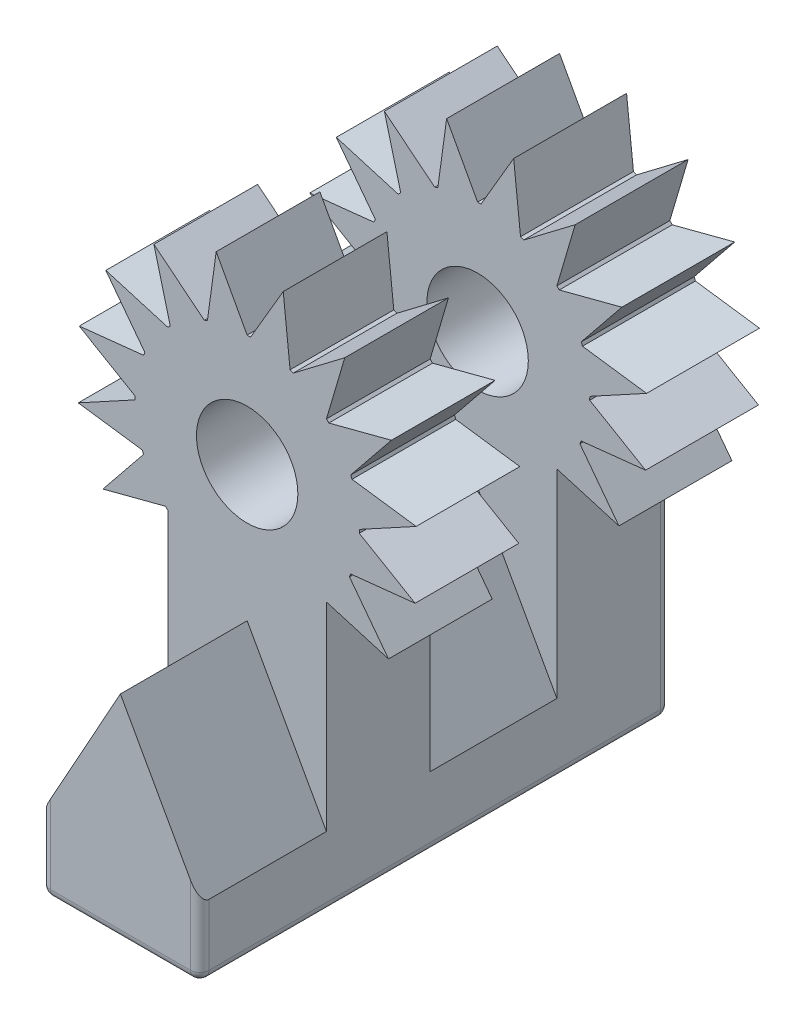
from build123d import *

# Parameters (mm, degrees)
SKETCH1_R           = 1.65
BOSS_EXTRUDE1_DEPTH = 15.3
BOSS_EXTRUDE2_START = -15.3
BOSS_EXTRUDE2_DEPTH = 15.3
CIRPATTERN1_COUNT   = 13
CIRPATTERN1_ANGLE   = 270
CUT_EXTRUDE1_START  = -4.125
SKETCH3_R           = 1.65
CUT_EXTRUDE1_DEPTH  = 4.125
LPATTERN1_COUNT     = 2
LPATTERN1_PITCH     = 7.5
FILLET1_R           = 0.3


with BuildPart() as part:
    # Sketch1 → Boss-Extrude1 (new body)
    with BuildSketch(Plane.XY):
        with BuildLine():
            Line((-2.580939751, 4.384530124), (-2.580939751, -4.384530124))
            Line((-2.580939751, -4.384530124), (2.580939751, -4.384530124))
            Line((2.580939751, -4.384530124), (2.580939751, 4.384530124))
            ThreePointArc((2.580939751, 4.384530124), (0, 10.615469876), (-2.580939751, 4.384530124))
        make_face()
        with Locations((0, 6.965469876)):
            Circle(SKETCH1_R, mode=Mode.SUBTRACT)
    extrude(amount=BOSS_EXTRUDE1_DEPTH)

    # Sketch2 → Boss-Extrude2 (add)
    with BuildSketch(Plane.XY.offset(15.3).offset(BOSS_EXTRUDE2_START)):
        with BuildLine():
            Line((4.600654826, 3.789867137), (3.328434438, 5.467463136))
            ThreePointArc((3.328434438, 5.467463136), (3.003891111, 4.89203355), (2.580939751, 4.384530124))
            Line((2.580939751, 4.384530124), (4.600654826, 3.789867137))
        make_face()
    boss_extrude2 = extrude(amount=BOSS_EXTRUDE2_DEPTH)

    # CirPattern1: Boss-Extrude2 ×13 about axis, 1 skipped
    cirpattern1_axis = Axis((0, 6.965469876, 0), (0, 0, 1))
    add([boss_extrude2.rotate(cirpattern1_axis, i * CIRPATTERN1_ANGLE / (CIRPATTERN1_COUNT - 1)) for i in range(1, CIRPATTERN1_COUNT) if i not in (12,)])

    # Sketch3 → Cut-Extrude1 (cut)
    # profile 1 of 2: a face of its own
    with BuildSketch(Plane.XY.offset(15.3).offset(CUT_EXTRUDE1_START)):
        with BuildLine():
            Line((-2.580939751, 4.384530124), (-2.580939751, -2.084296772))
            Line((-2.580939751, -2.084296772), (0, 2.565469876))
            Line((0, 2.565469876), (2.580939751, -2.084296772))
            Line((2.580939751, -2.084296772), (2.580939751, 4.384530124))
            Line((2.580939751, 4.384530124), (3.328434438, 5.467463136))
            ThreePointArc((3.328434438, 5.467463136), (3.350679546, 5.517904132), (3.372160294, 5.568675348))
            Line((3.372160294, 5.568675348), (5.465701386, 5.792189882))
            Line((5.465701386, 5.792189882), (3.648334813, 6.855228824))
            ThreePointArc((3.648334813, 6.855228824), (3.64958368, 6.910343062), (3.65, 6.965469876))
            Line((3.65, 6.965469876), (5.498644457, 7.97313387))
            Line((5.498644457, 7.97313387), (3.412809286, 8.259777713))
            ThreePointArc((3.412809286, 8.259777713), (3.392871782, 8.31117455), (3.372160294, 8.362264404))
            Line((3.372160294, 8.362264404), (4.694468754, 10.00067015))
            Line((4.694468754, 10.00067015), (2.657714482, 9.467279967))
            ThreePointArc((2.657714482, 9.467279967), (2.619625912, 9.5071347), (2.580939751, 9.546409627))
            Line((2.580939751, 9.546409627), (3.175602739, 11.566124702))
            Line((3.175602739, 11.566124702), (1.49800674, 10.293904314))
            ThreePointArc((1.49800674, 10.293904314), (1.447565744, 10.316149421), (1.396794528, 10.337630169))
            Line((1.396794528, 10.337630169), (1.173279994, 12.431171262))
            Line((1.173279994, 12.431171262), (0.110241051, 10.613804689))
            ThreePointArc((0.110241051, 10.613804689), (0.055126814, 10.615053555), (0, 10.615469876))
            Line((0, 10.615469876), (-1.007663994, 12.464114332))
            Line((-1.007663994, 12.464114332), (-1.294307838, 10.378279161))
            ThreePointArc((-1.294307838, 10.378279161), (-1.345704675, 10.358341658), (-1.396794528, 10.337630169))
            Line((-1.396794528, 10.337630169), (-3.035200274, 11.65993863))
            Line((-3.035200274, 11.65993863), (-2.501810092, 9.623184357))
            ThreePointArc((-2.501810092, 9.623184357), (-2.541664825, 9.585095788), (-2.580939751, 9.546409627))
            Line((-2.580939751, 9.546409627), (-4.600654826, 10.141072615))
            Line((-4.600654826, 10.141072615), (-3.328434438, 8.463476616))
            ThreePointArc((-3.328434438, 8.463476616), (-3.350679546, 8.41303562), (-3.372160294, 8.362264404))
            Line((-3.372160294, 8.362264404), (-5.465701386, 8.13874987))
            Line((-5.465701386, 8.13874987), (-3.648334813, 7.075710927))
            ThreePointArc((-3.648334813, 7.075710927), (-3.64958368, 7.020596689), (-3.65, 6.965469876))
            Line((-3.65, 6.965469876), (-5.498644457, 5.957805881))
            Line((-5.498644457, 5.957805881), (-3.412809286, 5.671162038))
            ThreePointArc((-3.412809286, 5.671162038), (-3.392871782, 5.619765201), (-3.372160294, 5.568675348))
            Line((-3.372160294, 5.568675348), (-4.694468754, 3.930269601))
            Line((-4.694468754, 3.930269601), (-2.657714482, 4.463659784))
            ThreePointArc((-2.657714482, 4.463659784), (-2.619625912, 4.423805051), (-2.580939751, 4.384530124))
        make_face()
        with Locations((0, 6.965469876)):
            Circle(SKETCH3_R, mode=Mode.SUBTRACT)
    # profile 2 of 2: a face of its own
    with BuildSketch(Plane.XY.offset(15.3).offset(CUT_EXTRUDE1_START)):
        Polygon((2.580939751, 4.384530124), (4.600654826, 3.789867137), (3.328434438, 5.467463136), align=None)
    cut_extrude1 = extrude(amount=CUT_EXTRUDE1_DEPTH, mode=Mode.SUBTRACT)

    # LPattern1: Cut-Extrude1 ×2
    with Locations(*[(0, 0, -i * LPATTERN1_PITCH) for i in range(1, LPATTERN1_COUNT)]):
        add(cut_extrude1, mode=Mode.SUBTRACT)

    # Fillet1
    fillet1_edges = [part.edges().sort_by_distance(p)[0] for p in [
        (0, -4.384530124, 15.3),
        (2.580939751, -3.234413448, 15.3),
        (-2.580939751, -3.234413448, 15.3),
        (2.580939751, 0, 0),
        (0, -4.384530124, 0),
        (-2.580939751, 0, 0),
        (2.580939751, -4.384530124, 7.65),
        (-2.580939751, -4.384530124, 7.65),
    ]]
    fillet(fillet1_edges, radius=FILLET1_R)


solid = part.part
